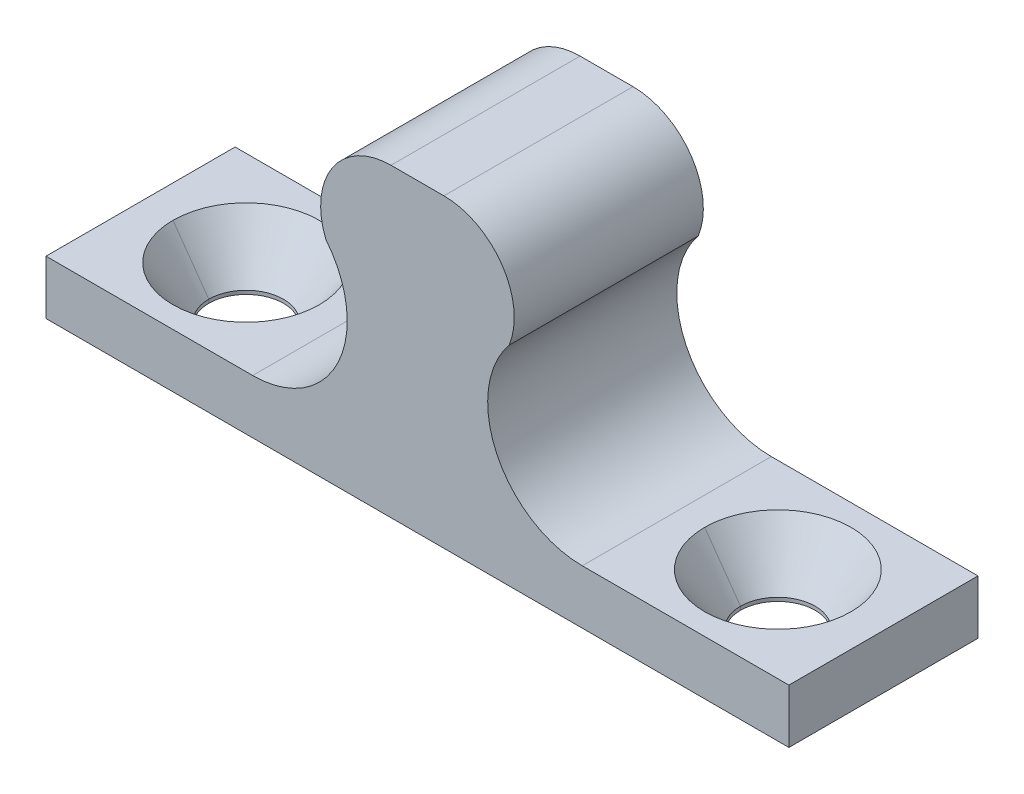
ISO-10303-21;
HEADER;
FILE_DESCRIPTION(('STEP AP214'),'2;1');
FILE_NAME('part.step','',(''),(''),'','','');
FILE_SCHEMA(('AUTOMOTIVE_DESIGN { 1 0 10303 214 1 1 1 1 }'));
ENDSEC;
DATA;
#1=APPLICATION_CONTEXT('core data for automotive mechanical design processes');
#2=APPLICATION_PROTOCOL_DEFINITION('international standard','automotive_design',2000,#1);
#3=PRODUCT_CONTEXT('',#1,'mechanical');
#4=PRODUCT('Part','Part','',(#3));
#5=PRODUCT_RELATED_PRODUCT_CATEGORY('part','',(#4));
#6=PRODUCT_DEFINITION_FORMATION('','',#4);
#7=PRODUCT_DEFINITION_CONTEXT('part definition',#1,'design');
#8=PRODUCT_DEFINITION('design','',#6,#7);
#9=PRODUCT_DEFINITION_SHAPE('','',#8);
#10=(LENGTH_UNIT() NAMED_UNIT(*) SI_UNIT(.MILLI.,.METRE.));
#11=(NAMED_UNIT(*) PLANE_ANGLE_UNIT() SI_UNIT($,.RADIAN.));
#12=(NAMED_UNIT(*) SI_UNIT($,.STERADIAN.) SOLID_ANGLE_UNIT());
#13=UNCERTAINTY_MEASURE_WITH_UNIT(LENGTH_MEASURE(1.E-05),#10,'distance_accuracy_value','');
#14=(GEOMETRIC_REPRESENTATION_CONTEXT(3) GLOBAL_UNCERTAINTY_ASSIGNED_CONTEXT((#13)) GLOBAL_UNIT_ASSIGNED_CONTEXT((#10,
#11,#12)) REPRESENTATION_CONTEXT('',''));
#15=CARTESIAN_POINT('',(0.,0.,0.));
#16=DIRECTION('',(0.,0.,1.));
#17=DIRECTION('',(1.,0.,0.));
#18=AXIS2_PLACEMENT_3D('',#15,#16,#17);
#19=CARTESIAN_POINT('',(34.0614,28.4479999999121,16.1798000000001));
#20=DIRECTION('',(0.,1.,0.));
#21=DIRECTION('',(0.,0.,1.));
#22=AXIS2_PLACEMENT_3D('',#19,#20,#21);
#23=CONICAL_SURFACE('',#22,4.12749999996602,0.617286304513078);
#24=CARTESIAN_POINT('',(34.0614,25.6032000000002,16.1798000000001));
#25=DIRECTION('',(0.,1.,0.));
#26=DIRECTION('',(0.,0.,1.));
#27=AXIS2_PLACEMENT_3D('',#24,#25,#26);
#28=CIRCLE('',#27,2.1082);
#29=CARTESIAN_POINT('',(36.1696009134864,25.6031999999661,16.1798000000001));
#30=VERTEX_POINT('',#29);
#31=CARTESIAN_POINT('',(31.9531993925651,25.6031995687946,16.1798000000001));
#32=VERTEX_POINT('',#31);
#33=EDGE_CURVE('E151',#30,#32,#28,.F.);
#34=ORIENTED_EDGE('',*,*,#33,.T.);
#35=DIRECTION('',(0.578824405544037,-0.815452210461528,0.));
#36=VECTOR('',#35,1.);
#37=CARTESIAN_POINT('',(-354150.125047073,499000.,16.1797999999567));
#38=LINE('',#37,#36);
#39=CARTESIAN_POINT('',(29.9338999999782,28.4480000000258,16.1798000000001));
#40=VERTEX_POINT('',#39);
#41=EDGE_CURVE('E162',#32,#40,#38,.F.);
#42=ORIENTED_EDGE('',*,*,#41,.T.);
#43=CARTESIAN_POINT('',(34.0614,28.4480000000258,16.1798000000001));
#44=DIRECTION('',(0.,1.,0.));
#45=DIRECTION('',(0.,0.,1.));
#46=AXIS2_PLACEMENT_3D('',#43,#44,#45);
#47=CIRCLE('',#46,4.12750000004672);
#48=CARTESIAN_POINT('',(38.1889000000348,28.4480000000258,16.1798000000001));
#49=VERTEX_POINT('',#48);
#50=EDGE_CURVE('E215',#49,#40,#47,.F.);
#51=ORIENTED_EDGE('',*,*,#50,.F.);
#52=DIRECTION('',(-0.578824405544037,-0.815452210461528,0.));
#53=VECTOR('',#52,1.);
#54=CARTESIAN_POINT('',(354218.247847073,499000.,16.1798000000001));
#55=LINE('',#54,#53);
#56=EDGE_CURVE('E137',#49,#30,#55,.T.);
#57=ORIENTED_EDGE('',*,*,#56,.T.);
#58=EDGE_LOOP('',(#34,#42,#51,#57));
#59=FACE_BOUND('',#58,.T.);
#60=ADVANCED_FACE('F16',(#59),#23,.F.);
#61=CARTESIAN_POINT('',(34.0614,28.4479999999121,16.1798000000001));
#62=DIRECTION('',(0.,1.,0.));
#63=DIRECTION('',(0.,0.,1.));
#64=AXIS2_PLACEMENT_3D('',#61,#62,#63);
#65=CONICAL_SURFACE('',#64,4.12749999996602,0.617286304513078);
#66=CARTESIAN_POINT('',(34.0614,28.4480000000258,16.1798000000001));
#67=DIRECTION('',(0.,1.,0.));
#68=DIRECTION('',(0.,0.,1.));
#69=AXIS2_PLACEMENT_3D('',#66,#67,#68);
#70=CIRCLE('',#69,4.12750000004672);
#71=EDGE_CURVE('E212',#40,#49,#70,.F.);
#72=ORIENTED_EDGE('',*,*,#71,.F.);
#73=ORIENTED_EDGE('',*,*,#41,.F.);
#74=CARTESIAN_POINT('',(34.0614,25.6032000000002,16.1798000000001));
#75=DIRECTION('',(0.,1.,0.));
#76=DIRECTION('',(0.,0.,1.));
#77=AXIS2_PLACEMENT_3D('',#74,#75,#76);
#78=CIRCLE('',#77,2.1082);
#79=EDGE_CURVE('E153',#32,#30,#78,.F.);
#80=ORIENTED_EDGE('',*,*,#79,.T.);
#81=ORIENTED_EDGE('',*,*,#56,.F.);
#82=EDGE_LOOP('',(#72,#73,#80,#81));
#83=FACE_BOUND('',#82,.T.);
#84=ADVANCED_FACE('F400',(#83),#65,.F.);
#85=CARTESIAN_POINT('',(4.064,28.4479999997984,16.1798000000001));
#86=DIRECTION('',(0.,1.,0.));
#87=DIRECTION('',(0.,0.,1.));
#88=AXIS2_PLACEMENT_3D('',#85,#86,#87);
#89=CONICAL_SURFACE('',#88,4.12749999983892,0.617286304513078);
#90=CARTESIAN_POINT('',(4.064,25.6032000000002,16.1798000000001));
#91=DIRECTION('',(0.,1.,0.));
#92=DIRECTION('',(0.,0.,1.));
#93=AXIS2_PLACEMENT_3D('',#90,#91,#92);
#94=CIRCLE('',#93,2.1082);
#95=CARTESIAN_POINT('',(6.17220091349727,25.6031999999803,16.1798000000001));
#96=VERTEX_POINT('',#95);
#97=CARTESIAN_POINT('',(1.95579939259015,25.6031995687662,16.1798000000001));
#98=VERTEX_POINT('',#97);
#99=EDGE_CURVE('E132',#96,#98,#94,.F.);
#100=ORIENTED_EDGE('',*,*,#99,.T.);
#101=DIRECTION('',(0.578824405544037,-0.815452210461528,0.));
#102=VECTOR('',#101,1.);
#103=CARTESIAN_POINT('',(-354180.122447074,499000.,16.1797999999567));
#104=LINE('',#103,#102);
#105=CARTESIAN_POINT('',(-0.0634999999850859,28.4479999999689,16.1798000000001));
#106=VERTEX_POINT('',#105);
#107=EDGE_CURVE('E128',#98,#106,#104,.F.);
#108=ORIENTED_EDGE('',*,*,#107,.T.);
#109=CARTESIAN_POINT('',(4.064,28.4479999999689,16.1798000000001));
#110=DIRECTION('',(0.,1.,0.));
#111=DIRECTION('',(0.,0.,1.));
#112=AXIS2_PLACEMENT_3D('',#109,#110,#111);
#113=CIRCLE('',#112,4.12749999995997);
#114=CARTESIAN_POINT('',(8.19149999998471,28.4479999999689,16.1798000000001));
#115=VERTEX_POINT('',#114);
#116=EDGE_CURVE('E19',#115,#106,#113,.F.);
#117=ORIENTED_EDGE('',*,*,#116,.F.);
#118=DIRECTION('',(-0.578824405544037,-0.815452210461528,0.));
#119=VECTOR('',#118,1.);
#120=CARTESIAN_POINT('',(354188.250447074,499000.,16.1798000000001));
#121=LINE('',#120,#119);
#122=EDGE_CURVE('E136',#115,#96,#121,.T.);
#123=ORIENTED_EDGE('',*,*,#122,.T.);
#124=EDGE_LOOP('',(#100,#108,#117,#123));
#125=FACE_BOUND('',#124,.T.);
#126=ADVANCED_FACE('F130',(#125),#89,.F.);
#127=CARTESIAN_POINT('',(4.064,28.4479999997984,16.1798000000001));
#128=DIRECTION('',(0.,1.,0.));
#129=DIRECTION('',(0.,0.,1.));
#130=AXIS2_PLACEMENT_3D('',#127,#128,#129);
#131=CONICAL_SURFACE('',#130,4.12749999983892,0.617286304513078);
#132=CARTESIAN_POINT('',(4.064,28.4479999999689,16.1798000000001));
#133=DIRECTION('',(0.,1.,0.));
#134=DIRECTION('',(0.,0.,1.));
#135=AXIS2_PLACEMENT_3D('',#132,#133,#134);
#136=CIRCLE('',#135,4.12749999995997);
#137=EDGE_CURVE('E140',#106,#115,#136,.F.);
#138=ORIENTED_EDGE('',*,*,#137,.F.);
#139=ORIENTED_EDGE('',*,*,#107,.F.);
#140=CARTESIAN_POINT('',(4.064,25.6032000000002,16.1798000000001));
#141=DIRECTION('',(0.,1.,0.));
#142=DIRECTION('',(0.,0.,1.));
#143=AXIS2_PLACEMENT_3D('',#140,#141,#142);
#144=CIRCLE('',#143,2.1082);
#145=EDGE_CURVE('E267',#98,#96,#144,.F.);
#146=ORIENTED_EDGE('',*,*,#145,.T.);
#147=ORIENTED_EDGE('',*,*,#122,.F.);
#148=EDGE_LOOP('',(#138,#139,#146,#147));
#149=FACE_BOUND('',#148,.T.);
#150=ADVANCED_FACE('F141',(#149),#131,.F.);
#151=CARTESIAN_POINT('',(-1.89230000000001,28.448,10.8458000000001));
#152=DIRECTION('',(0.,1.,0.));
#153=DIRECTION('',(0.,0.,1.));
#154=AXIS2_PLACEMENT_3D('',#151,#152,#153);
#155=PLANE('',#154);
#156=DIRECTION('',(1.,0.,0.));
#157=VECTOR('',#156,1.);
#158=CARTESIAN_POINT('',(19.0627,28.448,10.8458000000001));
#159=LINE('',#158,#157);
#160=CARTESIAN_POINT('',(-1.89230000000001,28.448,10.8458000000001));
#161=VERTEX_POINT('',#160);
#162=CARTESIAN_POINT('',(9.76629999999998,28.448,10.8458000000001));
#163=VERTEX_POINT('',#162);
#164=EDGE_CURVE('E197',#161,#163,#159,.T.);
#165=ORIENTED_EDGE('',*,*,#164,.F.);
#166=DIRECTION('',(0.,0.,1.));
#167=VECTOR('',#166,1.);
#168=CARTESIAN_POINT('',(-1.89230000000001,28.448,10.8458000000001));
#169=LINE('',#168,#167);
#170=CARTESIAN_POINT('',(-1.89230000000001,28.448,21.5138000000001));
#171=VERTEX_POINT('',#170);
#172=EDGE_CURVE('E238',#171,#161,#169,.F.);
#173=ORIENTED_EDGE('',*,*,#172,.F.);
#174=DIRECTION('',(-1.,0.,0.));
#175=VECTOR('',#174,1.);
#176=CARTESIAN_POINT('',(9.76629999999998,28.448,21.5138000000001));
#177=LINE('',#176,#175);
#178=CARTESIAN_POINT('',(9.76629999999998,28.448,21.5138000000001));
#179=VERTEX_POINT('',#178);
#180=EDGE_CURVE('E202',#171,#179,#177,.F.);
#181=ORIENTED_EDGE('',*,*,#180,.T.);
#182=DIRECTION('',(0.,0.,1.));
#183=VECTOR('',#182,1.);
#184=CARTESIAN_POINT('',(9.76629999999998,28.4480000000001,10.8458000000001));
#185=LINE('',#184,#183);
#186=EDGE_CURVE('E143',#163,#179,#185,.T.);
#187=ORIENTED_EDGE('',*,*,#186,.F.);
#188=EDGE_LOOP('',(#165,#173,#181,#187));
#189=FACE_BOUND('',#188,.T.);
#190=ORIENTED_EDGE('',*,*,#116,.T.);
#191=ORIENTED_EDGE('',*,*,#137,.T.);
#192=EDGE_LOOP('',(#190,#191));
#193=FACE_BOUND('',#192,.T.);
#194=ADVANCED_FACE('F144',(#189,#193),#155,.T.);
#195=CARTESIAN_POINT('',(9.76629999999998,33.782,10.8458000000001));
#196=DIRECTION('',(0.,0.,1.));
#197=DIRECTION('',(1.,0.,0.));
#198=AXIS2_PLACEMENT_3D('',#195,#196,#197);
#199=CYLINDRICAL_SURFACE('',#198,5.334);
#200=CARTESIAN_POINT('',(9.76629999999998,33.782,10.8458000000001));
#201=DIRECTION('',(0.,0.,1.));
#202=DIRECTION('',(1.,0.,0.));
#203=AXIS2_PLACEMENT_3D('',#200,#201,#202);
#204=CIRCLE('',#203,5.334);
#205=CARTESIAN_POINT('',(13.8917104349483,37.1632046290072,10.8458000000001));
#206=VERTEX_POINT('',#205);
#207=EDGE_CURVE('E194',#163,#206,#204,.T.);
#208=ORIENTED_EDGE('',*,*,#207,.F.);
#209=ORIENTED_EDGE('',*,*,#186,.T.);
#210=CARTESIAN_POINT('',(9.76629999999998,33.782,21.5138000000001));
#211=DIRECTION('',(0.,0.,1.));
#212=DIRECTION('',(1.,0.,0.));
#213=AXIS2_PLACEMENT_3D('',#210,#211,#212);
#214=CIRCLE('',#213,5.334);
#215=CARTESIAN_POINT('',(13.8917104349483,37.1632046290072,21.5138000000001));
#216=VERTEX_POINT('',#215);
#217=EDGE_CURVE('E198',#179,#216,#214,.T.);
#218=ORIENTED_EDGE('',*,*,#217,.T.);
#219=DIRECTION('',(0.,0.,1.));
#220=VECTOR('',#219,1.);
#221=CARTESIAN_POINT('',(13.8917104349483,37.1632046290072,10.8458000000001));
#222=LINE('',#221,#220);
#223=EDGE_CURVE('E234',#206,#216,#222,.T.);
#224=ORIENTED_EDGE('',*,*,#223,.F.);
#225=EDGE_LOOP('',(#208,#209,#218,#224));
#226=FACE_BOUND('',#225,.T.);
#227=ADVANCED_FACE('F337',(#226),#199,.F.);
#228=CARTESIAN_POINT('',(17.57045,38.65245,10.8458000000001));
#229=DIRECTION('',(0.,0.,1.));
#230=DIRECTION('',(1.,0.,0.));
#231=AXIS2_PLACEMENT_3D('',#228,#229,#230);
#232=CYLINDRICAL_SURFACE('',#231,3.96875);
#233=CARTESIAN_POINT('',(17.57045,38.65245,10.8458000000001));
#234=DIRECTION('',(0.,0.,1.));
#235=DIRECTION('',(1.,0.,0.));
#236=AXIS2_PLACEMENT_3D('',#233,#234,#235);
#237=CIRCLE('',#236,3.96875);
#238=CARTESIAN_POINT('',(17.57045,42.6212,10.8458000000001));
#239=VERTEX_POINT('',#238);
#240=EDGE_CURVE('E191',#206,#239,#237,.F.);
#241=ORIENTED_EDGE('',*,*,#240,.F.);
#242=ORIENTED_EDGE('',*,*,#223,.T.);
#243=CARTESIAN_POINT('',(17.57045,38.65245,21.5138000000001));
#244=DIRECTION('',(0.,0.,1.));
#245=DIRECTION('',(1.,0.,0.));
#246=AXIS2_PLACEMENT_3D('',#243,#244,#245);
#247=CIRCLE('',#246,3.96875);
#248=CARTESIAN_POINT('',(17.57045,42.6212,21.5138000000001));
#249=VERTEX_POINT('',#248);
#250=EDGE_CURVE('E209',#216,#249,#247,.F.);
#251=ORIENTED_EDGE('',*,*,#250,.T.);
#252=DIRECTION('',(0.,0.,1.));
#253=VECTOR('',#252,1.);
#254=CARTESIAN_POINT('',(17.57045,42.6212,10.8458000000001));
#255=LINE('',#254,#253);
#256=EDGE_CURVE('E226',#239,#249,#255,.T.);
#257=ORIENTED_EDGE('',*,*,#256,.F.);
#258=EDGE_LOOP('',(#241,#242,#251,#257));
#259=FACE_BOUND('',#258,.T.);
#260=ADVANCED_FACE('F341',(#259),#232,.T.);
#261=CARTESIAN_POINT('',(17.57045,42.6212,10.8458000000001));
#262=DIRECTION('',(0.,1.,0.));
#263=DIRECTION('',(0.,0.,1.));
#264=AXIS2_PLACEMENT_3D('',#261,#262,#263);
#265=PLANE('',#264);
#266=DIRECTION('',(1.,0.,0.));
#267=VECTOR('',#266,1.);
#268=CARTESIAN_POINT('',(19.0627,42.6212,10.8458000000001));
#269=LINE('',#268,#267);
#270=CARTESIAN_POINT('',(20.55495,42.6212,10.8458000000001));
#271=VERTEX_POINT('',#270);
#272=EDGE_CURVE('E190',#239,#271,#269,.T.);
#273=ORIENTED_EDGE('',*,*,#272,.F.);
#274=ORIENTED_EDGE('',*,*,#256,.T.);
#275=DIRECTION('',(-1.,0.,0.));
#276=VECTOR('',#275,1.);
#277=CARTESIAN_POINT('',(9.76629999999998,42.6212,21.5138000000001));
#278=LINE('',#277,#276);
#279=CARTESIAN_POINT('',(20.55495,42.6212,21.5138000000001));
#280=VERTEX_POINT('',#279);
#281=EDGE_CURVE('E208',#249,#280,#278,.F.);
#282=ORIENTED_EDGE('',*,*,#281,.T.);
#283=DIRECTION('',(0.,0.,1.));
#284=VECTOR('',#283,1.);
#285=CARTESIAN_POINT('',(20.55495,42.6212,10.8458000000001));
#286=LINE('',#285,#284);
#287=EDGE_CURVE('E220',#271,#280,#286,.T.);
#288=ORIENTED_EDGE('',*,*,#287,.F.);
#289=EDGE_LOOP('',(#273,#274,#282,#288));
#290=FACE_BOUND('',#289,.T.);
#291=ADVANCED_FACE('F345',(#290),#265,.T.);
#292=CARTESIAN_POINT('',(20.55495,38.65245,10.8458000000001));
#293=DIRECTION('',(0.,0.,1.));
#294=DIRECTION('',(1.,0.,0.));
#295=AXIS2_PLACEMENT_3D('',#292,#293,#294);
#296=CYLINDRICAL_SURFACE('',#295,3.96875);
#297=CARTESIAN_POINT('',(20.55495,38.65245,10.8458000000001));
#298=DIRECTION('',(0.,0.,1.));
#299=DIRECTION('',(1.,0.,0.));
#300=AXIS2_PLACEMENT_3D('',#297,#298,#299);
#301=CIRCLE('',#300,3.96875);
#302=CARTESIAN_POINT('',(24.2336895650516,37.1632046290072,10.8458000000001));
#303=VERTEX_POINT('',#302);
#304=EDGE_CURVE('E187',#271,#303,#301,.F.);
#305=ORIENTED_EDGE('',*,*,#304,.F.);
#306=ORIENTED_EDGE('',*,*,#287,.T.);
#307=CARTESIAN_POINT('',(20.55495,38.65245,21.5138000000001));
#308=DIRECTION('',(0.,0.,1.));
#309=DIRECTION('',(1.,0.,0.));
#310=AXIS2_PLACEMENT_3D('',#307,#308,#309);
#311=CIRCLE('',#310,3.96875);
#312=CARTESIAN_POINT('',(24.2336895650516,37.1632046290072,21.5138000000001));
#313=VERTEX_POINT('',#312);
#314=EDGE_CURVE('E206',#280,#313,#311,.F.);
#315=ORIENTED_EDGE('',*,*,#314,.T.);
#316=DIRECTION('',(0.,0.,1.));
#317=VECTOR('',#316,1.);
#318=CARTESIAN_POINT('',(24.2336895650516,37.1632046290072,10.8458000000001));
#319=LINE('',#318,#317);
#320=EDGE_CURVE('E217',#303,#313,#319,.T.);
#321=ORIENTED_EDGE('',*,*,#320,.F.);
#322=EDGE_LOOP('',(#305,#306,#315,#321));
#323=FACE_BOUND('',#322,.T.);
#324=ADVANCED_FACE('F349',(#323),#296,.T.);
#325=CARTESIAN_POINT('',(28.3591,33.782,10.8458000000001));
#326=DIRECTION('',(0.,0.,1.));
#327=DIRECTION('',(1.,0.,0.));
#328=AXIS2_PLACEMENT_3D('',#325,#326,#327);
#329=CYLINDRICAL_SURFACE('',#328,5.334);
#330=CARTESIAN_POINT('',(28.3591,33.782,10.8458000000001));
#331=DIRECTION('',(0.,0.,1.));
#332=DIRECTION('',(1.,0.,0.));
#333=AXIS2_PLACEMENT_3D('',#330,#331,#332);
#334=CIRCLE('',#333,5.334);
#335=CARTESIAN_POINT('',(28.3591,28.448,10.8458000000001));
#336=VERTEX_POINT('',#335);
#337=EDGE_CURVE('E183',#303,#336,#334,.T.);
#338=ORIENTED_EDGE('',*,*,#337,.F.);
#339=ORIENTED_EDGE('',*,*,#320,.T.);
#340=CARTESIAN_POINT('',(28.3591,33.782,21.5138000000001));
#341=DIRECTION('',(0.,0.,1.));
#342=DIRECTION('',(1.,0.,0.));
#343=AXIS2_PLACEMENT_3D('',#340,#341,#342);
#344=CIRCLE('',#343,5.334);
#345=CARTESIAN_POINT('',(28.3591,28.448,21.5138000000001));
#346=VERTEX_POINT('',#345);
#347=EDGE_CURVE('E203',#313,#346,#344,.T.);
#348=ORIENTED_EDGE('',*,*,#347,.T.);
#349=DIRECTION('',(0.,0.,1.));
#350=VECTOR('',#349,1.);
#351=CARTESIAN_POINT('',(28.3591,28.448,10.8458000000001));
#352=LINE('',#351,#350);
#353=EDGE_CURVE('E154',#336,#346,#352,.T.);
#354=ORIENTED_EDGE('',*,*,#353,.F.);
#355=EDGE_LOOP('',(#338,#339,#348,#354));
#356=FACE_BOUND('',#355,.T.);
#357=ADVANCED_FACE('F350',(#356),#329,.F.);
#358=CARTESIAN_POINT('',(28.3591,28.448,10.8458000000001));
#359=DIRECTION('',(0.,1.,0.));
#360=DIRECTION('',(0.,0.,1.));
#361=AXIS2_PLACEMENT_3D('',#358,#359,#360);
#362=PLANE('',#361);
#363=DIRECTION('',(1.,0.,0.));
#364=VECTOR('',#363,1.);
#365=CARTESIAN_POINT('',(19.0627,28.448,10.8458000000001));
#366=LINE('',#365,#364);
#367=CARTESIAN_POINT('',(40.0176999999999,28.448,10.8458000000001));
#368=VERTEX_POINT('',#367);
#369=EDGE_CURVE('E186',#336,#368,#366,.T.);
#370=ORIENTED_EDGE('',*,*,#369,.F.);
#371=ORIENTED_EDGE('',*,*,#353,.T.);
#372=DIRECTION('',(-1.,0.,0.));
#373=VECTOR('',#372,1.);
#374=CARTESIAN_POINT('',(9.76629999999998,28.448,21.5138000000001));
#375=LINE('',#374,#373);
#376=CARTESIAN_POINT('',(40.0176999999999,28.448,21.5138000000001));
#377=VERTEX_POINT('',#376);
#378=EDGE_CURVE('E205',#346,#377,#375,.F.);
#379=ORIENTED_EDGE('',*,*,#378,.T.);
#380=DIRECTION('',(0.,0.,1.));
#381=VECTOR('',#380,1.);
#382=CARTESIAN_POINT('',(40.0176999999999,28.448,10.8458000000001));
#383=LINE('',#382,#381);
#384=EDGE_CURVE('E182',#368,#377,#383,.T.);
#385=ORIENTED_EDGE('',*,*,#384,.F.);
#386=EDGE_LOOP('',(#370,#371,#379,#385));
#387=FACE_BOUND('',#386,.T.);
#388=ORIENTED_EDGE('',*,*,#50,.T.);
#389=ORIENTED_EDGE('',*,*,#71,.T.);
#390=EDGE_LOOP('',(#388,#389));
#391=FACE_BOUND('',#390,.T.);
#392=ADVANCED_FACE('F326',(#387,#391),#362,.T.);
#393=CARTESIAN_POINT('',(34.0614,25.4000000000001,16.1798000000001));
#394=DIRECTION('',(0.,1.,0.));
#395=DIRECTION('',(0.,0.,1.));
#396=AXIS2_PLACEMENT_3D('',#393,#394,#395);
#397=CYLINDRICAL_SURFACE('',#396,2.1082);
#398=ORIENTED_EDGE('',*,*,#33,.F.);
#399=DIRECTION('',(0.,1.,0.));
#400=VECTOR('',#399,1.);
#401=CARTESIAN_POINT('',(36.1696,25.4000000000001,16.1798000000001));
#402=LINE('',#401,#400);
#403=CARTESIAN_POINT('',(36.1696,25.4000000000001,16.1798000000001));
#404=VERTEX_POINT('',#403);
#405=EDGE_CURVE('E159',#30,#404,#402,.F.);
#406=ORIENTED_EDGE('',*,*,#405,.T.);
#407=CARTESIAN_POINT('',(34.0614,25.4000000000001,16.1798000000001));
#408=DIRECTION('',(0.,1.,0.));
#409=DIRECTION('',(0.,0.,1.));
#410=AXIS2_PLACEMENT_3D('',#407,#408,#409);
#411=CIRCLE('',#410,2.1082);
#412=CARTESIAN_POINT('',(31.9532,25.4000000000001,16.1798000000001));
#413=VERTEX_POINT('',#412);
#414=EDGE_CURVE('E179',#413,#404,#411,.T.);
#415=ORIENTED_EDGE('',*,*,#414,.F.);
#416=DIRECTION('',(0.,1.,0.));
#417=VECTOR('',#416,1.);
#418=CARTESIAN_POINT('',(31.9532,25.4000000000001,16.1798000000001));
#419=LINE('',#418,#417);
#420=EDGE_CURVE('E268',#413,#32,#419,.T.);
#421=ORIENTED_EDGE('',*,*,#420,.T.);
#422=EDGE_LOOP('',(#398,#406,#415,#421));
#423=FACE_BOUND('',#422,.T.);
#424=ADVANCED_FACE('F358',(#423),#397,.F.);
#425=CARTESIAN_POINT('',(34.0614,25.4000000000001,16.1798000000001));
#426=DIRECTION('',(0.,1.,0.));
#427=DIRECTION('',(0.,0.,1.));
#428=AXIS2_PLACEMENT_3D('',#425,#426,#427);
#429=CYLINDRICAL_SURFACE('',#428,2.1082);
#430=CARTESIAN_POINT('',(34.0614,25.4000000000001,16.1798000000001));
#431=DIRECTION('',(0.,1.,0.));
#432=DIRECTION('',(0.,0.,1.));
#433=AXIS2_PLACEMENT_3D('',#430,#431,#432);
#434=CIRCLE('',#433,2.1082);
#435=EDGE_CURVE('E176',#404,#413,#434,.T.);
#436=ORIENTED_EDGE('',*,*,#435,.F.);
#437=ORIENTED_EDGE('',*,*,#405,.F.);
#438=ORIENTED_EDGE('',*,*,#79,.F.);
#439=ORIENTED_EDGE('',*,*,#420,.F.);
#440=EDGE_LOOP('',(#436,#437,#438,#439));
#441=FACE_BOUND('',#440,.T.);
#442=ADVANCED_FACE('F381',(#441),#429,.F.);
#443=CARTESIAN_POINT('',(4.064,25.4000000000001,16.1798000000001));
#444=DIRECTION('',(0.,1.,0.));
#445=DIRECTION('',(0.,0.,1.));
#446=AXIS2_PLACEMENT_3D('',#443,#444,#445);
#447=CYLINDRICAL_SURFACE('',#446,2.1082);
#448=ORIENTED_EDGE('',*,*,#99,.F.);
#449=DIRECTION('',(0.,1.,0.));
#450=VECTOR('',#449,1.);
#451=CARTESIAN_POINT('',(6.1722,25.4000000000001,16.1798000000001));
#452=LINE('',#451,#450);
#453=CARTESIAN_POINT('',(6.1722,25.4000000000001,16.1798000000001));
#454=VERTEX_POINT('',#453);
#455=EDGE_CURVE('E272',#96,#454,#452,.F.);
#456=ORIENTED_EDGE('',*,*,#455,.T.);
#457=CARTESIAN_POINT('',(4.064,25.4000000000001,16.1798000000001));
#458=DIRECTION('',(0.,1.,0.));
#459=DIRECTION('',(0.,0.,1.));
#460=AXIS2_PLACEMENT_3D('',#457,#458,#459);
#461=CIRCLE('',#460,2.1082);
#462=CARTESIAN_POINT('',(1.9558,25.4000000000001,16.1798000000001));
#463=VERTEX_POINT('',#462);
#464=EDGE_CURVE('E173',#463,#454,#461,.T.);
#465=ORIENTED_EDGE('',*,*,#464,.F.);
#466=DIRECTION('',(0.,1.,0.));
#467=VECTOR('',#466,1.);
#468=CARTESIAN_POINT('',(1.9558,25.4000000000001,16.1798000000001));
#469=LINE('',#468,#467);
#470=EDGE_CURVE('E211',#463,#98,#469,.T.);
#471=ORIENTED_EDGE('',*,*,#470,.T.);
#472=EDGE_LOOP('',(#448,#456,#465,#471));
#473=FACE_BOUND('',#472,.T.);
#474=ADVANCED_FACE('F377',(#473),#447,.F.);
#475=CARTESIAN_POINT('',(4.064,25.4000000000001,16.1798000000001));
#476=DIRECTION('',(0.,1.,0.));
#477=DIRECTION('',(0.,0.,1.));
#478=AXIS2_PLACEMENT_3D('',#475,#476,#477);
#479=CYLINDRICAL_SURFACE('',#478,2.1082);
#480=CARTESIAN_POINT('',(4.064,25.4000000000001,16.1798000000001));
#481=DIRECTION('',(0.,1.,0.));
#482=DIRECTION('',(0.,0.,1.));
#483=AXIS2_PLACEMENT_3D('',#480,#481,#482);
#484=CIRCLE('',#483,2.1082);
#485=EDGE_CURVE('E169',#454,#463,#484,.T.);
#486=ORIENTED_EDGE('',*,*,#485,.F.);
#487=ORIENTED_EDGE('',*,*,#455,.F.);
#488=ORIENTED_EDGE('',*,*,#145,.F.);
#489=ORIENTED_EDGE('',*,*,#470,.F.);
#490=EDGE_LOOP('',(#486,#487,#488,#489));
#491=FACE_BOUND('',#490,.T.);
#492=ADVANCED_FACE('F374',(#491),#479,.F.);
#493=CARTESIAN_POINT('',(9.76629999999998,28.448,21.5138000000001));
#494=DIRECTION('',(0.,0.,-1.));
#495=DIRECTION('',(-1.,0.,0.));
#496=AXIS2_PLACEMENT_3D('',#493,#494,#495);
#497=PLANE('',#496);
#498=ORIENTED_EDGE('',*,*,#180,.F.);
#499=DIRECTION('',(0.,1.,0.));
#500=VECTOR('',#499,1.);
#501=CARTESIAN_POINT('',(-1.89230000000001,25.4000000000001,21.5138000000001));
#502=LINE('',#501,#500);
#503=CARTESIAN_POINT('',(-1.89230000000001,25.4000000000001,21.5138000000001));
#504=VERTEX_POINT('',#503);
#505=EDGE_CURVE('E201',#504,#171,#502,.T.);
#506=ORIENTED_EDGE('',*,*,#505,.F.);
#507=DIRECTION('',(1.,0.,0.));
#508=VECTOR('',#507,1.);
#509=CARTESIAN_POINT('',(40.0176999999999,25.4000000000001,21.5138000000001));
#510=LINE('',#509,#508);
#511=CARTESIAN_POINT('',(40.0176999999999,25.4000000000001,21.5138000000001));
#512=VERTEX_POINT('',#511);
#513=EDGE_CURVE('E172',#512,#504,#510,.F.);
#514=ORIENTED_EDGE('',*,*,#513,.F.);
#515=DIRECTION('',(0.,1.,0.));
#516=VECTOR('',#515,1.);
#517=CARTESIAN_POINT('',(40.0176999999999,28.448,21.5138000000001));
#518=LINE('',#517,#516);
#519=EDGE_CURVE('E246',#377,#512,#518,.F.);
#520=ORIENTED_EDGE('',*,*,#519,.F.);
#521=ORIENTED_EDGE('',*,*,#378,.F.);
#522=ORIENTED_EDGE('',*,*,#347,.F.);
#523=ORIENTED_EDGE('',*,*,#314,.F.);
#524=ORIENTED_EDGE('',*,*,#281,.F.);
#525=ORIENTED_EDGE('',*,*,#250,.F.);
#526=ORIENTED_EDGE('',*,*,#217,.F.);
#527=EDGE_LOOP('',(#498,#506,#514,#520,#521,#522,#523,#524,#525,#526));
#528=FACE_BOUND('',#527,.T.);
#529=ADVANCED_FACE('F328',(#528),#497,.F.);
#530=CARTESIAN_POINT('',(-1.89230000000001,25.4000000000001,10.8458000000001));
#531=DIRECTION('',(-1.,0.,0.));
#532=DIRECTION('',(0.,0.,1.));
#533=AXIS2_PLACEMENT_3D('',#530,#531,#532);
#534=PLANE('',#533);
#535=DIRECTION('',(0.,1.,0.));
#536=VECTOR('',#535,1.);
#537=CARTESIAN_POINT('',(-1.89230000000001,33.4929849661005,10.8458000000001));
#538=LINE('',#537,#536);
#539=CARTESIAN_POINT('',(-1.89230000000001,25.4000000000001,10.8458000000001));
#540=VERTEX_POINT('',#539);
#541=EDGE_CURVE('E243',#540,#161,#538,.T.);
#542=ORIENTED_EDGE('',*,*,#541,.F.);
#543=DIRECTION('',(0.,0.,-1.));
#544=VECTOR('',#543,1.);
#545=CARTESIAN_POINT('',(-1.89230000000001,25.4000000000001,10.8458000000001));
#546=LINE('',#545,#544);
#547=EDGE_CURVE('E253',#504,#540,#546,.T.);
#548=ORIENTED_EDGE('',*,*,#547,.F.);
#549=ORIENTED_EDGE('',*,*,#505,.T.);
#550=ORIENTED_EDGE('',*,*,#172,.T.);
#551=EDGE_LOOP('',(#542,#548,#549,#550));
#552=FACE_BOUND('',#551,.T.);
#553=ADVANCED_FACE('F332',(#552),#534,.T.);
#554=CARTESIAN_POINT('',(19.0627,33.4929849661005,10.8458000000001));
#555=DIRECTION('',(0.,0.,-1.));
#556=DIRECTION('',(0.,1.,0.));
#557=AXIS2_PLACEMENT_3D('',#554,#555,#556);
#558=PLANE('',#557);
#559=DIRECTION('',(1.,0.,0.));
#560=VECTOR('',#559,1.);
#561=CARTESIAN_POINT('',(40.0176999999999,25.4000000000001,10.8458000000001));
#562=LINE('',#561,#560);
#563=CARTESIAN_POINT('',(40.0176999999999,25.4000000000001,10.8458000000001));
#564=VERTEX_POINT('',#563);
#565=EDGE_CURVE('E25',#540,#564,#562,.T.);
#566=ORIENTED_EDGE('',*,*,#565,.F.);
#567=ORIENTED_EDGE('',*,*,#541,.T.);
#568=ORIENTED_EDGE('',*,*,#164,.T.);
#569=ORIENTED_EDGE('',*,*,#207,.T.);
#570=ORIENTED_EDGE('',*,*,#240,.T.);
#571=ORIENTED_EDGE('',*,*,#272,.T.);
#572=ORIENTED_EDGE('',*,*,#304,.T.);
#573=ORIENTED_EDGE('',*,*,#337,.T.);
#574=ORIENTED_EDGE('',*,*,#369,.T.);
#575=DIRECTION('',(0.,1.,0.));
#576=VECTOR('',#575,1.);
#577=CARTESIAN_POINT('',(40.0176999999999,28.448,10.8458000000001));
#578=LINE('',#577,#576);
#579=EDGE_CURVE('E34',#564,#368,#578,.T.);
#580=ORIENTED_EDGE('',*,*,#579,.F.);
#581=EDGE_LOOP('',(#566,#567,#568,#569,#570,#571,#572,#573,#574,#580));
#582=FACE_BOUND('',#581,.T.);
#583=ADVANCED_FACE('F333',(#582),#558,.T.);
#584=CARTESIAN_POINT('',(40.0176999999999,28.448,10.8458000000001));
#585=DIRECTION('',(1.,0.,0.));
#586=DIRECTION('',(0.,1.,0.));
#587=AXIS2_PLACEMENT_3D('',#584,#585,#586);
#588=PLANE('',#587);
#589=ORIENTED_EDGE('',*,*,#579,.T.);
#590=ORIENTED_EDGE('',*,*,#384,.T.);
#591=ORIENTED_EDGE('',*,*,#519,.T.);
#592=DIRECTION('',(0.,0.,-1.));
#593=VECTOR('',#592,1.);
#594=CARTESIAN_POINT('',(40.0176999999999,25.4000000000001,10.8458000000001));
#595=LINE('',#594,#593);
#596=EDGE_CURVE('E10',#564,#512,#595,.F.);
#597=ORIENTED_EDGE('',*,*,#596,.F.);
#598=EDGE_LOOP('',(#589,#590,#591,#597));
#599=FACE_BOUND('',#598,.T.);
#600=ADVANCED_FACE('F300',(#599),#588,.T.);
#601=CARTESIAN_POINT('',(40.0176999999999,25.4000000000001,10.8458000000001));
#602=DIRECTION('',(0.,-1.,0.));
#603=DIRECTION('',(0.,0.,-1.));
#604=AXIS2_PLACEMENT_3D('',#601,#602,#603);
#605=PLANE('',#604);
#606=ORIENTED_EDGE('',*,*,#565,.T.);
#607=ORIENTED_EDGE('',*,*,#596,.T.);
#608=ORIENTED_EDGE('',*,*,#513,.T.);
#609=ORIENTED_EDGE('',*,*,#547,.T.);
#610=EDGE_LOOP('',(#606,#607,#608,#609));
#611=FACE_BOUND('',#610,.T.);
#612=ORIENTED_EDGE('',*,*,#464,.T.);
#613=ORIENTED_EDGE('',*,*,#485,.T.);
#614=EDGE_LOOP('',(#612,#613));
#615=FACE_BOUND('',#614,.T.);
#616=ORIENTED_EDGE('',*,*,#414,.T.);
#617=ORIENTED_EDGE('',*,*,#435,.T.);
#618=EDGE_LOOP('',(#616,#617));
#619=FACE_BOUND('',#618,.T.);
#620=ADVANCED_FACE('F305',(#611,#615,#619),#605,.T.);
#621=CLOSED_SHELL('',(#60,#84,#126,#150,#194,#227,#260,#291,#324,#357,#392,#424,#442,#474,#492,
#529,#553,#583,#600,#620));
#622=MANIFOLD_SOLID_BREP('B1',#621);
#623=ADVANCED_BREP_SHAPE_REPRESENTATION('',(#18,#622),#14);
#624=SHAPE_DEFINITION_REPRESENTATION(#9,#623);
ENDSEC;
END-ISO-10303-21;
